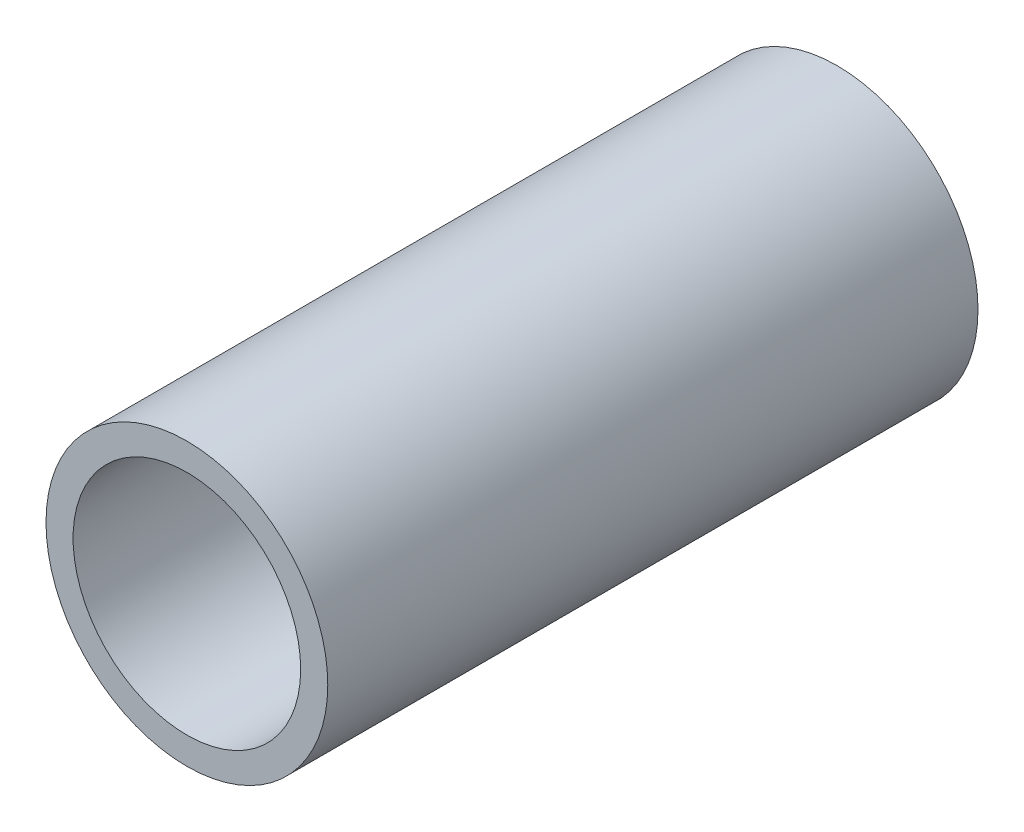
from build123d import *

# Parameters (mm, degrees)
SKETCH_1_R          = 13
SKETCH_1_R_2        = 10.5
EXTRUDE_1_DEPTH     = 60
SKETCH_2_R          = 5.5
CUT_EXTRUDE_1_DEPTH = 60


with BuildPart() as part:
    # Sketch 1 → Extrude 1 (new body)
    with BuildSketch(Plane.XY):
        Circle(SKETCH_1_R)
        Circle(SKETCH_1_R_2, mode=Mode.SUBTRACT)
    extrude(amount=EXTRUDE_1_DEPTH)

    # Sketch 2 → Cut-Extrude 1 (cut)
    with BuildSketch(Plane(origin=(0, 0, 0), x_dir=(1, 0, 0), z_dir=(0, 1, 0))):
        with Locations(Location((0, -25, 0), (0, 0, 270))):
            Circle(SKETCH_2_R)
    extrude(amount=-CUT_EXTRUDE_1_DEPTH, mode=Mode.SUBTRACT)


solid = part.part
